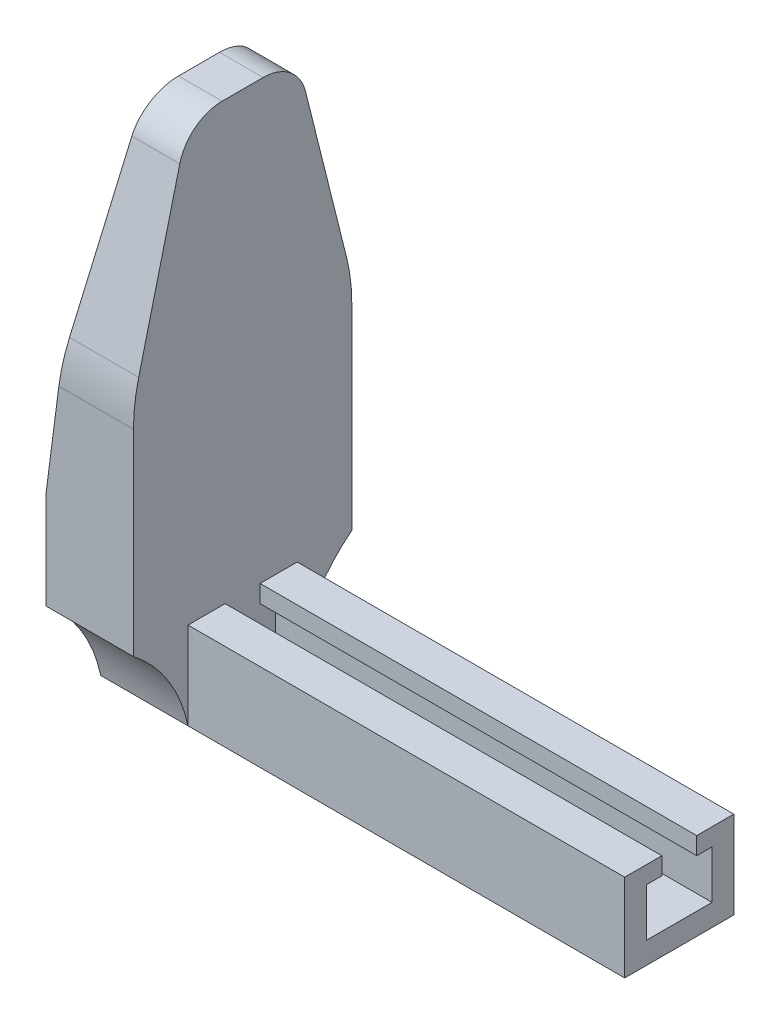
ISO-10303-21;
HEADER;
FILE_DESCRIPTION(('STEP AP214'),'2;1');
FILE_NAME('part.step','',(''),(''),'','','');
FILE_SCHEMA(('AUTOMOTIVE_DESIGN { 1 0 10303 214 1 1 1 1 }'));
ENDSEC;
DATA;
#1=APPLICATION_CONTEXT('core data for automotive mechanical design processes');
#2=APPLICATION_PROTOCOL_DEFINITION('international standard','automotive_design',2000,#1);
#3=PRODUCT_CONTEXT('',#1,'mechanical');
#4=PRODUCT('Part','Part','',(#3));
#5=PRODUCT_RELATED_PRODUCT_CATEGORY('part','',(#4));
#6=PRODUCT_DEFINITION_FORMATION('','',#4);
#7=PRODUCT_DEFINITION_CONTEXT('part definition',#1,'design');
#8=PRODUCT_DEFINITION('design','',#6,#7);
#9=PRODUCT_DEFINITION_SHAPE('','',#8);
#10=(LENGTH_UNIT() NAMED_UNIT(*) SI_UNIT(.MILLI.,.METRE.));
#11=(NAMED_UNIT(*) PLANE_ANGLE_UNIT() SI_UNIT($,.RADIAN.));
#12=(NAMED_UNIT(*) SI_UNIT($,.STERADIAN.) SOLID_ANGLE_UNIT());
#13=UNCERTAINTY_MEASURE_WITH_UNIT(LENGTH_MEASURE(1.E-05),#10,'distance_accuracy_value','');
#14=(GEOMETRIC_REPRESENTATION_CONTEXT(3) GLOBAL_UNCERTAINTY_ASSIGNED_CONTEXT((#13)) GLOBAL_UNIT_ASSIGNED_CONTEXT((#10,
#11,#12)) REPRESENTATION_CONTEXT('',''));
#15=CARTESIAN_POINT('',(0.,0.,0.));
#16=DIRECTION('',(0.,0.,1.));
#17=DIRECTION('',(1.,0.,0.));
#18=AXIS2_PLACEMENT_3D('',#15,#16,#17);
#19=CARTESIAN_POINT('',(100.,-10.,-12.5));
#20=DIRECTION('',(0.,0.,1.));
#21=DIRECTION('',(1.,0.,0.));
#22=AXIS2_PLACEMENT_3D('',#19,#20,#21);
#23=PLANE('',#22);
#24=DIRECTION('',(0.,1.,0.));
#25=VECTOR('',#24,1.);
#26=CARTESIAN_POINT('',(0.,-10.,-12.5));
#27=LINE('',#26,#25);
#28=CARTESIAN_POINT('',(0.,-10.,-12.5));
#29=VERTEX_POINT('',#28);
#30=CARTESIAN_POINT('',(0.,10.,-12.5));
#31=VERTEX_POINT('',#30);
#32=EDGE_CURVE('E142',#29,#31,#27,.T.);
#33=ORIENTED_EDGE('',*,*,#32,.T.);
#34=DIRECTION('',(-1.,0.,0.));
#35=VECTOR('',#34,1.);
#36=CARTESIAN_POINT('',(100.,10.,-12.5));
#37=LINE('',#36,#35);
#38=CARTESIAN_POINT('',(100.,10.,-12.5));
#39=VERTEX_POINT('',#38);
#40=EDGE_CURVE('E11',#39,#31,#37,.T.);
#41=ORIENTED_EDGE('',*,*,#40,.F.);
#42=DIRECTION('',(0.,1.,0.));
#43=VECTOR('',#42,1.);
#44=CARTESIAN_POINT('',(100.,-10.,-12.5));
#45=LINE('',#44,#43);
#46=CARTESIAN_POINT('',(100.,-10.,-12.5));
#47=VERTEX_POINT('',#46);
#48=EDGE_CURVE('E169',#47,#39,#45,.T.);
#49=ORIENTED_EDGE('',*,*,#48,.F.);
#50=DIRECTION('',(-1.,0.,0.));
#51=VECTOR('',#50,1.);
#52=CARTESIAN_POINT('',(100.,-10.,-12.5));
#53=LINE('',#52,#51);
#54=EDGE_CURVE('E138',#47,#29,#53,.T.);
#55=ORIENTED_EDGE('',*,*,#54,.T.);
#56=EDGE_LOOP('',(#33,#41,#49,#55));
#57=FACE_BOUND('',#56,.T.);
#58=ADVANCED_FACE('F38',(#57),#23,.F.);
#59=CARTESIAN_POINT('',(100.,10.,-4.));
#60=DIRECTION('',(0.,-1.,0.));
#61=DIRECTION('',(0.,0.,-1.));
#62=AXIS2_PLACEMENT_3D('',#59,#60,#61);
#63=PLANE('',#62);
#64=DIRECTION('',(0.,0.,1.));
#65=VECTOR('',#64,1.);
#66=CARTESIAN_POINT('',(0.,10.,-4.));
#67=LINE('',#66,#65);
#68=CARTESIAN_POINT('',(0.,10.,-4.));
#69=VERTEX_POINT('',#68);
#70=EDGE_CURVE('E145',#31,#69,#67,.T.);
#71=ORIENTED_EDGE('',*,*,#70,.T.);
#72=DIRECTION('',(-1.,0.,0.));
#73=VECTOR('',#72,1.);
#74=CARTESIAN_POINT('',(100.,10.,-4.));
#75=LINE('',#74,#73);
#76=CARTESIAN_POINT('',(100.,10.,-4.));
#77=VERTEX_POINT('',#76);
#78=EDGE_CURVE('E45',#77,#69,#75,.T.);
#79=ORIENTED_EDGE('',*,*,#78,.F.);
#80=DIRECTION('',(0.,0.,1.));
#81=VECTOR('',#80,1.);
#82=CARTESIAN_POINT('',(100.,10.,-4.));
#83=LINE('',#82,#81);
#84=EDGE_CURVE('E201',#39,#77,#83,.T.);
#85=ORIENTED_EDGE('',*,*,#84,.F.);
#86=ORIENTED_EDGE('',*,*,#40,.T.);
#87=EDGE_LOOP('',(#71,#79,#85,#86));
#88=FACE_BOUND('',#87,.T.);
#89=ADVANCED_FACE('F200',(#88),#63,.F.);
#90=CARTESIAN_POINT('',(100.,10.,-4.));
#91=DIRECTION('',(0.,0.,-1.));
#92=DIRECTION('',(0.,1.,0.));
#93=AXIS2_PLACEMENT_3D('',#90,#91,#92);
#94=PLANE('',#93);
#95=DIRECTION('',(0.,-1.,0.));
#96=VECTOR('',#95,1.);
#97=CARTESIAN_POINT('',(0.,10.,-4.));
#98=LINE('',#97,#96);
#99=CARTESIAN_POINT('',(0.,6.,-4.));
#100=VERTEX_POINT('',#99);
#101=EDGE_CURVE('E74',#69,#100,#98,.T.);
#102=ORIENTED_EDGE('',*,*,#101,.T.);
#103=DIRECTION('',(-1.,0.,0.));
#104=VECTOR('',#103,1.);
#105=CARTESIAN_POINT('',(100.,6.,-4.));
#106=LINE('',#105,#104);
#107=CARTESIAN_POINT('',(100.,6.,-4.));
#108=VERTEX_POINT('',#107);
#109=EDGE_CURVE('E189',#108,#100,#106,.T.);
#110=ORIENTED_EDGE('',*,*,#109,.F.);
#111=DIRECTION('',(0.,-1.,0.));
#112=VECTOR('',#111,1.);
#113=CARTESIAN_POINT('',(100.,10.,-4.));
#114=LINE('',#113,#112);
#115=EDGE_CURVE('E198',#77,#108,#114,.T.);
#116=ORIENTED_EDGE('',*,*,#115,.F.);
#117=ORIENTED_EDGE('',*,*,#78,.T.);
#118=EDGE_LOOP('',(#102,#110,#116,#117));
#119=FACE_BOUND('',#118,.T.);
#120=ADVANCED_FACE('F195',(#119),#94,.F.);
#121=CARTESIAN_POINT('',(100.,6.,-4.));
#122=DIRECTION('',(0.,1.,0.));
#123=DIRECTION('',(0.,0.,1.));
#124=AXIS2_PLACEMENT_3D('',#121,#122,#123);
#125=PLANE('',#124);
#126=DIRECTION('',(0.,0.,-1.));
#127=VECTOR('',#126,1.);
#128=CARTESIAN_POINT('',(0.,6.,-4.));
#129=LINE('',#128,#127);
#130=CARTESIAN_POINT('',(0.,6.,-7.5));
#131=VERTEX_POINT('',#130);
#132=EDGE_CURVE('E149',#100,#131,#129,.T.);
#133=ORIENTED_EDGE('',*,*,#132,.T.);
#134=DIRECTION('',(-1.,0.,0.));
#135=VECTOR('',#134,1.);
#136=CARTESIAN_POINT('',(100.,6.,-7.5));
#137=LINE('',#136,#135);
#138=CARTESIAN_POINT('',(100.,6.,-7.5));
#139=VERTEX_POINT('',#138);
#140=EDGE_CURVE('E186',#139,#131,#137,.T.);
#141=ORIENTED_EDGE('',*,*,#140,.F.);
#142=DIRECTION('',(0.,0.,-1.));
#143=VECTOR('',#142,1.);
#144=CARTESIAN_POINT('',(100.,6.,-4.));
#145=LINE('',#144,#143);
#146=EDGE_CURVE('E247',#108,#139,#145,.T.);
#147=ORIENTED_EDGE('',*,*,#146,.F.);
#148=ORIENTED_EDGE('',*,*,#109,.T.);
#149=EDGE_LOOP('',(#133,#141,#147,#148));
#150=FACE_BOUND('',#149,.T.);
#151=ADVANCED_FACE('F429',(#150),#125,.F.);
#152=CARTESIAN_POINT('',(100.,6.,-7.5));
#153=DIRECTION('',(0.,0.,-1.));
#154=DIRECTION('',(0.,1.,0.));
#155=AXIS2_PLACEMENT_3D('',#152,#153,#154);
#156=PLANE('',#155);
#157=DIRECTION('',(0.,-1.,0.));
#158=VECTOR('',#157,1.);
#159=CARTESIAN_POINT('',(0.,6.,-7.5));
#160=LINE('',#159,#158);
#161=CARTESIAN_POINT('',(0.,-4.99999999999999,-7.5));
#162=VERTEX_POINT('',#161);
#163=EDGE_CURVE('E152',#131,#162,#160,.T.);
#164=ORIENTED_EDGE('',*,*,#163,.T.);
#165=DIRECTION('',(-1.,0.,0.));
#166=VECTOR('',#165,1.);
#167=CARTESIAN_POINT('',(100.,-4.99999999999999,-7.5));
#168=LINE('',#167,#166);
#169=CARTESIAN_POINT('',(100.,-4.99999999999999,-7.5));
#170=VERTEX_POINT('',#169);
#171=EDGE_CURVE('E183',#170,#162,#168,.T.);
#172=ORIENTED_EDGE('',*,*,#171,.F.);
#173=DIRECTION('',(0.,-1.,0.));
#174=VECTOR('',#173,1.);
#175=CARTESIAN_POINT('',(100.,6.,-7.5));
#176=LINE('',#175,#174);
#177=EDGE_CURVE('E245',#139,#170,#176,.T.);
#178=ORIENTED_EDGE('',*,*,#177,.F.);
#179=ORIENTED_EDGE('',*,*,#140,.T.);
#180=EDGE_LOOP('',(#164,#172,#178,#179));
#181=FACE_BOUND('',#180,.T.);
#182=ADVANCED_FACE('F433',(#181),#156,.F.);
#183=CARTESIAN_POINT('',(100.,-4.99999999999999,7.5));
#184=DIRECTION('',(0.,-1.,0.));
#185=DIRECTION('',(0.,0.,-1.));
#186=AXIS2_PLACEMENT_3D('',#183,#184,#185);
#187=PLANE('',#186);
#188=DIRECTION('',(0.,0.,1.));
#189=VECTOR('',#188,1.);
#190=CARTESIAN_POINT('',(0.,-4.99999999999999,7.5));
#191=LINE('',#190,#189);
#192=CARTESIAN_POINT('',(0.,-4.99999999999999,7.5));
#193=VERTEX_POINT('',#192);
#194=EDGE_CURVE('E155',#162,#193,#191,.T.);
#195=ORIENTED_EDGE('',*,*,#194,.T.);
#196=DIRECTION('',(-1.,0.,0.));
#197=VECTOR('',#196,1.);
#198=CARTESIAN_POINT('',(100.,-4.99999999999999,7.5));
#199=LINE('',#198,#197);
#200=CARTESIAN_POINT('',(100.,-4.99999999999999,7.5));
#201=VERTEX_POINT('',#200);
#202=EDGE_CURVE('E180',#201,#193,#199,.T.);
#203=ORIENTED_EDGE('',*,*,#202,.F.);
#204=DIRECTION('',(0.,0.,1.));
#205=VECTOR('',#204,1.);
#206=CARTESIAN_POINT('',(100.,-4.99999999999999,7.5));
#207=LINE('',#206,#205);
#208=EDGE_CURVE('E243',#170,#201,#207,.T.);
#209=ORIENTED_EDGE('',*,*,#208,.F.);
#210=ORIENTED_EDGE('',*,*,#171,.T.);
#211=EDGE_LOOP('',(#195,#203,#209,#210));
#212=FACE_BOUND('',#211,.T.);
#213=ADVANCED_FACE('F438',(#212),#187,.F.);
#214=CARTESIAN_POINT('',(100.,6.,7.5));
#215=DIRECTION('',(0.,0.,1.));
#216=DIRECTION('',(1.,0.,0.));
#217=AXIS2_PLACEMENT_3D('',#214,#215,#216);
#218=PLANE('',#217);
#219=DIRECTION('',(0.,1.,0.));
#220=VECTOR('',#219,1.);
#221=CARTESIAN_POINT('',(0.,6.,7.5));
#222=LINE('',#221,#220);
#223=CARTESIAN_POINT('',(0.,6.,7.5));
#224=VERTEX_POINT('',#223);
#225=EDGE_CURVE('E158',#193,#224,#222,.T.);
#226=ORIENTED_EDGE('',*,*,#225,.T.);
#227=DIRECTION('',(-1.,0.,0.));
#228=VECTOR('',#227,1.);
#229=CARTESIAN_POINT('',(100.,6.,7.5));
#230=LINE('',#229,#228);
#231=CARTESIAN_POINT('',(100.,6.,7.5));
#232=VERTEX_POINT('',#231);
#233=EDGE_CURVE('E177',#232,#224,#230,.T.);
#234=ORIENTED_EDGE('',*,*,#233,.F.);
#235=DIRECTION('',(0.,1.,0.));
#236=VECTOR('',#235,1.);
#237=CARTESIAN_POINT('',(100.,6.,7.5));
#238=LINE('',#237,#236);
#239=EDGE_CURVE('E239',#201,#232,#238,.T.);
#240=ORIENTED_EDGE('',*,*,#239,.F.);
#241=ORIENTED_EDGE('',*,*,#202,.T.);
#242=EDGE_LOOP('',(#226,#234,#240,#241));
#243=FACE_BOUND('',#242,.T.);
#244=ADVANCED_FACE('F440',(#243),#218,.F.);
#245=CARTESIAN_POINT('',(100.,6.,7.5));
#246=DIRECTION('',(0.,1.,0.));
#247=DIRECTION('',(0.,0.,1.));
#248=AXIS2_PLACEMENT_3D('',#245,#246,#247);
#249=PLANE('',#248);
#250=DIRECTION('',(0.,0.,-1.));
#251=VECTOR('',#250,1.);
#252=CARTESIAN_POINT('',(0.,6.,7.5));
#253=LINE('',#252,#251);
#254=CARTESIAN_POINT('',(0.,6.,4.));
#255=VERTEX_POINT('',#254);
#256=EDGE_CURVE('E161',#224,#255,#253,.T.);
#257=ORIENTED_EDGE('',*,*,#256,.T.);
#258=DIRECTION('',(-1.,0.,0.));
#259=VECTOR('',#258,1.);
#260=CARTESIAN_POINT('',(100.,6.,4.));
#261=LINE('',#260,#259);
#262=CARTESIAN_POINT('',(100.,6.,4.));
#263=VERTEX_POINT('',#262);
#264=EDGE_CURVE('E174',#263,#255,#261,.T.);
#265=ORIENTED_EDGE('',*,*,#264,.F.);
#266=DIRECTION('',(0.,0.,-1.));
#267=VECTOR('',#266,1.);
#268=CARTESIAN_POINT('',(100.,6.,7.5));
#269=LINE('',#268,#267);
#270=EDGE_CURVE('E238',#232,#263,#269,.T.);
#271=ORIENTED_EDGE('',*,*,#270,.F.);
#272=ORIENTED_EDGE('',*,*,#233,.T.);
#273=EDGE_LOOP('',(#257,#265,#271,#272));
#274=FACE_BOUND('',#273,.T.);
#275=ADVANCED_FACE('F234',(#274),#249,.F.);
#276=CARTESIAN_POINT('',(100.,10.,4.));
#277=DIRECTION('',(0.,0.,1.));
#278=DIRECTION('',(0.,-1.,0.));
#279=AXIS2_PLACEMENT_3D('',#276,#277,#278);
#280=PLANE('',#279);
#281=DIRECTION('',(0.,1.,0.));
#282=VECTOR('',#281,1.);
#283=CARTESIAN_POINT('',(0.,10.,4.));
#284=LINE('',#283,#282);
#285=CARTESIAN_POINT('',(0.,10.,4.));
#286=VERTEX_POINT('',#285);
#287=EDGE_CURVE('E164',#255,#286,#284,.T.);
#288=ORIENTED_EDGE('',*,*,#287,.T.);
#289=DIRECTION('',(-1.,0.,0.));
#290=VECTOR('',#289,1.);
#291=CARTESIAN_POINT('',(100.,10.,4.));
#292=LINE('',#291,#290);
#293=CARTESIAN_POINT('',(100.,10.,4.));
#294=VERTEX_POINT('',#293);
#295=EDGE_CURVE('E132',#294,#286,#292,.T.);
#296=ORIENTED_EDGE('',*,*,#295,.F.);
#297=DIRECTION('',(0.,1.,0.));
#298=VECTOR('',#297,1.);
#299=CARTESIAN_POINT('',(100.,10.,4.));
#300=LINE('',#299,#298);
#301=EDGE_CURVE('E122',#263,#294,#300,.T.);
#302=ORIENTED_EDGE('',*,*,#301,.F.);
#303=ORIENTED_EDGE('',*,*,#264,.T.);
#304=EDGE_LOOP('',(#288,#296,#302,#303));
#305=FACE_BOUND('',#304,.T.);
#306=ADVANCED_FACE('F237',(#305),#280,.F.);
#307=CARTESIAN_POINT('',(100.,10.,12.5));
#308=DIRECTION('',(0.,-1.,0.));
#309=DIRECTION('',(0.,0.,-1.));
#310=AXIS2_PLACEMENT_3D('',#307,#308,#309);
#311=PLANE('',#310);
#312=DIRECTION('',(0.,0.,1.));
#313=VECTOR('',#312,1.);
#314=CARTESIAN_POINT('',(0.,10.,12.5));
#315=LINE('',#314,#313);
#316=CARTESIAN_POINT('',(0.,10.,12.5));
#317=VERTEX_POINT('',#316);
#318=EDGE_CURVE('E130',#286,#317,#315,.T.);
#319=ORIENTED_EDGE('',*,*,#318,.T.);
#320=DIRECTION('',(-1.,0.,0.));
#321=VECTOR('',#320,1.);
#322=CARTESIAN_POINT('',(100.,10.,12.5));
#323=LINE('',#322,#321);
#324=CARTESIAN_POINT('',(100.,10.,12.5));
#325=VERTEX_POINT('',#324);
#326=EDGE_CURVE('E128',#325,#317,#323,.T.);
#327=ORIENTED_EDGE('',*,*,#326,.F.);
#328=DIRECTION('',(0.,0.,1.));
#329=VECTOR('',#328,1.);
#330=CARTESIAN_POINT('',(100.,10.,12.5));
#331=LINE('',#330,#329);
#332=EDGE_CURVE('E115',#294,#325,#331,.T.);
#333=ORIENTED_EDGE('',*,*,#332,.F.);
#334=ORIENTED_EDGE('',*,*,#295,.T.);
#335=EDGE_LOOP('',(#319,#327,#333,#334));
#336=FACE_BOUND('',#335,.T.);
#337=ADVANCED_FACE('F129',(#336),#311,.F.);
#338=CARTESIAN_POINT('',(100.,-10.,12.5));
#339=DIRECTION('',(0.,0.,-1.));
#340=DIRECTION('',(-1.,0.,0.));
#341=AXIS2_PLACEMENT_3D('',#338,#339,#340);
#342=PLANE('',#341);
#343=DIRECTION('',(0.,-1.,0.));
#344=VECTOR('',#343,1.);
#345=CARTESIAN_POINT('',(0.,-10.,12.5));
#346=LINE('',#345,#344);
#347=CARTESIAN_POINT('',(0.,-10.,12.5));
#348=VERTEX_POINT('',#347);
#349=EDGE_CURVE('E85',#317,#348,#346,.T.);
#350=ORIENTED_EDGE('',*,*,#349,.T.);
#351=DIRECTION('',(-1.,0.,0.));
#352=VECTOR('',#351,1.);
#353=CARTESIAN_POINT('',(100.,-10.,12.5));
#354=LINE('',#353,#352);
#355=CARTESIAN_POINT('',(100.,-10.,12.5));
#356=VERTEX_POINT('',#355);
#357=EDGE_CURVE('E133',#356,#348,#354,.T.);
#358=ORIENTED_EDGE('',*,*,#357,.F.);
#359=DIRECTION('',(0.,-1.,0.));
#360=VECTOR('',#359,1.);
#361=CARTESIAN_POINT('',(100.,-10.,12.5));
#362=LINE('',#361,#360);
#363=EDGE_CURVE('E119',#325,#356,#362,.T.);
#364=ORIENTED_EDGE('',*,*,#363,.F.);
#365=ORIENTED_EDGE('',*,*,#326,.T.);
#366=EDGE_LOOP('',(#350,#358,#364,#365));
#367=FACE_BOUND('',#366,.T.);
#368=ADVANCED_FACE('F135',(#367),#342,.F.);
#369=CARTESIAN_POINT('',(100.,-10.,12.5));
#370=DIRECTION('',(0.,1.,0.));
#371=DIRECTION('',(0.,0.,1.));
#372=AXIS2_PLACEMENT_3D('',#369,#370,#371);
#373=PLANE('',#372);
#374=ORIENTED_EDGE('',*,*,#357,.T.);
#375=DIRECTION('',(1.,0.,0.));
#376=VECTOR('',#375,1.);
#377=CARTESIAN_POINT('',(-20.,-10.,12.5));
#378=LINE('',#377,#376);
#379=CARTESIAN_POINT('',(-20.,-10.,12.5));
#380=VERTEX_POINT('',#379);
#381=EDGE_CURVE('E253',#380,#348,#378,.T.);
#382=ORIENTED_EDGE('',*,*,#381,.F.);
#383=DIRECTION('',(0.,0.,-1.));
#384=VECTOR('',#383,1.);
#385=CARTESIAN_POINT('',(-20.,-10.,12.5));
#386=LINE('',#385,#384);
#387=CARTESIAN_POINT('',(-20.,-10.,-12.5));
#388=VERTEX_POINT('',#387);
#389=EDGE_CURVE('E329',#380,#388,#386,.T.);
#390=ORIENTED_EDGE('',*,*,#389,.T.);
#391=DIRECTION('',(1.,0.,0.));
#392=VECTOR('',#391,1.);
#393=CARTESIAN_POINT('',(-20.,-10.,-12.5));
#394=LINE('',#393,#392);
#395=EDGE_CURVE('E146',#388,#29,#394,.T.);
#396=ORIENTED_EDGE('',*,*,#395,.T.);
#397=ORIENTED_EDGE('',*,*,#54,.F.);
#398=DIRECTION('',(0.,0.,-1.));
#399=VECTOR('',#398,1.);
#400=CARTESIAN_POINT('',(100.,-10.,12.5));
#401=LINE('',#400,#399);
#402=EDGE_CURVE('E61',#356,#47,#401,.T.);
#403=ORIENTED_EDGE('',*,*,#402,.F.);
#404=EDGE_LOOP('',(#374,#382,#390,#396,#397,#403));
#405=FACE_BOUND('',#404,.T.);
#406=ADVANCED_FACE('F423',(#405),#373,.F.);
#407=CARTESIAN_POINT('',(100.,0.,0.));
#408=DIRECTION('',(-1.,0.,0.));
#409=DIRECTION('',(0.,0.,1.));
#410=AXIS2_PLACEMENT_3D('',#407,#408,#409);
#411=PLANE('',#410);
#412=ORIENTED_EDGE('',*,*,#48,.T.);
#413=ORIENTED_EDGE('',*,*,#84,.T.);
#414=ORIENTED_EDGE('',*,*,#115,.T.);
#415=ORIENTED_EDGE('',*,*,#146,.T.);
#416=ORIENTED_EDGE('',*,*,#177,.T.);
#417=ORIENTED_EDGE('',*,*,#208,.T.);
#418=ORIENTED_EDGE('',*,*,#239,.T.);
#419=ORIENTED_EDGE('',*,*,#270,.T.);
#420=ORIENTED_EDGE('',*,*,#301,.T.);
#421=ORIENTED_EDGE('',*,*,#332,.T.);
#422=ORIENTED_EDGE('',*,*,#363,.T.);
#423=ORIENTED_EDGE('',*,*,#402,.T.);
#424=EDGE_LOOP('',(#412,#413,#414,#415,#416,#417,#418,#419,#420,#421,#422,#423));
#425=FACE_BOUND('',#424,.T.);
#426=ADVANCED_FACE('F117',(#425),#411,.F.);
#427=CARTESIAN_POINT('',(0.,-17.0483299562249,-46.0273279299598));
#428=DIRECTION('',(1.,0.,0.));
#429=DIRECTION('',(0.,0.,-1.));
#430=AXIS2_PLACEMENT_3D('',#427,#428,#429);
#431=PLANE('',#430);
#432=ORIENTED_EDGE('',*,*,#32,.F.);
#433=CARTESIAN_POINT('',(0.,-17.0483299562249,-46.0273279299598));
#434=DIRECTION('',(1.,0.,0.));
#435=DIRECTION('',(0.,0.,-1.));
#436=AXIS2_PLACEMENT_3D('',#433,#434,#435);
#437=CIRCLE('',#436,34.2601907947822);
#438=CARTESIAN_POINT('',(0.,10.,-25.));
#439=VERTEX_POINT('',#438);
#440=EDGE_CURVE('E317',#439,#29,#437,.T.);
#441=ORIENTED_EDGE('',*,*,#440,.F.);
#442=DIRECTION('',(0.,1.,0.));
#443=VECTOR('',#442,1.);
#444=CARTESIAN_POINT('',(0.,10.,-25.));
#445=LINE('',#444,#443);
#446=CARTESIAN_POINT('',(0.,55.0757749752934,-25.));
#447=VERTEX_POINT('',#446);
#448=EDGE_CURVE('E287',#439,#447,#445,.T.);
#449=ORIENTED_EDGE('',*,*,#448,.T.);
#450=CARTESIAN_POINT('',(0.,55.0757749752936,15.));
#451=DIRECTION('',(-1.,0.,0.));
#452=DIRECTION('',(0.,0.,1.));
#453=AXIS2_PLACEMENT_3D('',#450,#451,#452);
#454=CIRCLE('',#453,40.);
#455=CARTESIAN_POINT('',(0.,64.777199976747,-23.8057000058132));
#456=VERTEX_POINT('',#455);
#457=EDGE_CURVE('E291',#456,#447,#454,.T.);
#458=ORIENTED_EDGE('',*,*,#457,.F.);
#459=DIRECTION('',(0.,0.970142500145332,0.242535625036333));
#460=VECTOR('',#459,1.);
#461=CARTESIAN_POINT('',(0.,64.777199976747,-23.8057000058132));
#462=LINE('',#461,#460);
#463=CARTESIAN_POINT('',(0.,102.425356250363,-14.3936609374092));
#464=VERTEX_POINT('',#463);
#465=EDGE_CURVE('E294',#456,#464,#462,.T.);
#466=ORIENTED_EDGE('',*,*,#465,.T.);
#467=CARTESIAN_POINT('',(0.,100.,-4.69223593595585));
#468=DIRECTION('',(1.,0.,0.));
#469=DIRECTION('',(0.,0.,-1.));
#470=AXIS2_PLACEMENT_3D('',#467,#468,#469);
#471=CIRCLE('',#470,10.);
#472=CARTESIAN_POINT('',(0.,110.,-4.6922359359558));
#473=VERTEX_POINT('',#472);
#474=EDGE_CURVE('E297',#464,#473,#471,.T.);
#475=ORIENTED_EDGE('',*,*,#474,.T.);
#476=DIRECTION('',(0.,0.,-1.));
#477=VECTOR('',#476,1.);
#478=CARTESIAN_POINT('',(0.,110.,4.69223593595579));
#479=LINE('',#478,#477);
#480=CARTESIAN_POINT('',(0.,110.,4.69223593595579));
#481=VERTEX_POINT('',#480);
#482=EDGE_CURVE('E300',#481,#473,#479,.T.);
#483=ORIENTED_EDGE('',*,*,#482,.F.);
#484=CARTESIAN_POINT('',(0.,100.,4.69223593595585));
#485=DIRECTION('',(-1.,0.,0.));
#486=DIRECTION('',(0.,0.,1.));
#487=AXIS2_PLACEMENT_3D('',#484,#485,#486);
#488=CIRCLE('',#487,10.);
#489=CARTESIAN_POINT('',(0.,102.425356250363,14.3936609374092));
#490=VERTEX_POINT('',#489);
#491=EDGE_CURVE('E303',#490,#481,#488,.T.);
#492=ORIENTED_EDGE('',*,*,#491,.F.);
#493=DIRECTION('',(0.,0.970142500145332,-0.242535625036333));
#494=VECTOR('',#493,1.);
#495=CARTESIAN_POINT('',(0.,64.7771999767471,23.8057000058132));
#496=LINE('',#495,#494);
#497=CARTESIAN_POINT('',(0.,64.7771999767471,23.8057000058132));
#498=VERTEX_POINT('',#497);
#499=EDGE_CURVE('E306',#498,#490,#496,.T.);
#500=ORIENTED_EDGE('',*,*,#499,.F.);
#501=CARTESIAN_POINT('',(0.,55.0757749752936,-15.));
#502=DIRECTION('',(1.,0.,0.));
#503=DIRECTION('',(0.,0.,-1.));
#504=AXIS2_PLACEMENT_3D('',#501,#502,#503);
#505=CIRCLE('',#504,40.);
#506=CARTESIAN_POINT('',(0.,55.0757749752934,25.));
#507=VERTEX_POINT('',#506);
#508=EDGE_CURVE('E309',#498,#507,#505,.T.);
#509=ORIENTED_EDGE('',*,*,#508,.T.);
#510=DIRECTION('',(0.,1.,0.));
#511=VECTOR('',#510,1.);
#512=CARTESIAN_POINT('',(0.,10.,25.));
#513=LINE('',#512,#511);
#514=CARTESIAN_POINT('',(0.,10.,25.));
#515=VERTEX_POINT('',#514);
#516=EDGE_CURVE('E312',#515,#507,#513,.T.);
#517=ORIENTED_EDGE('',*,*,#516,.F.);
#518=CARTESIAN_POINT('',(0.,-17.0483299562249,46.0273279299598));
#519=DIRECTION('',(-1.,0.,0.));
#520=DIRECTION('',(0.,0.,1.));
#521=AXIS2_PLACEMENT_3D('',#518,#519,#520);
#522=CIRCLE('',#521,34.2601907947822);
#523=EDGE_CURVE('E315',#515,#348,#522,.T.);
#524=ORIENTED_EDGE('',*,*,#523,.T.);
#525=ORIENTED_EDGE('',*,*,#349,.F.);
#526=ORIENTED_EDGE('',*,*,#318,.F.);
#527=ORIENTED_EDGE('',*,*,#287,.F.);
#528=ORIENTED_EDGE('',*,*,#256,.F.);
#529=ORIENTED_EDGE('',*,*,#225,.F.);
#530=ORIENTED_EDGE('',*,*,#194,.F.);
#531=ORIENTED_EDGE('',*,*,#163,.F.);
#532=ORIENTED_EDGE('',*,*,#132,.F.);
#533=ORIENTED_EDGE('',*,*,#101,.F.);
#534=ORIENTED_EDGE('',*,*,#70,.F.);
#535=EDGE_LOOP('',(#432,#441,#449,#458,#466,#475,#483,#492,#500,#509,#517,#524,#525,#526,#527,
#528,#529,#530,#531,#532,#533,#534));
#536=FACE_BOUND('',#535,.T.);
#537=ADVANCED_FACE('F205',(#536),#431,.T.);
#538=CARTESIAN_POINT('',(-20.,-17.0483299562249,-46.0273279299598));
#539=DIRECTION('',(1.,0.,0.));
#540=DIRECTION('',(0.,0.,-1.));
#541=AXIS2_PLACEMENT_3D('',#538,#539,#540);
#542=CYLINDRICAL_SURFACE('',#541,34.2601907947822);
#543=ORIENTED_EDGE('',*,*,#440,.T.);
#544=ORIENTED_EDGE('',*,*,#395,.F.);
#545=CARTESIAN_POINT('',(-20.,-17.0483299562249,-46.0273279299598));
#546=DIRECTION('',(1.,0.,0.));
#547=DIRECTION('',(0.,0.,-1.));
#548=AXIS2_PLACEMENT_3D('',#545,#546,#547);
#549=CIRCLE('',#548,34.2601907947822);
#550=CARTESIAN_POINT('',(-20.,10.,-25.));
#551=VERTEX_POINT('',#550);
#552=EDGE_CURVE('E290',#551,#388,#549,.T.);
#553=ORIENTED_EDGE('',*,*,#552,.F.);
#554=DIRECTION('',(1.,0.,0.));
#555=VECTOR('',#554,1.);
#556=CARTESIAN_POINT('',(-20.,10.,-25.));
#557=LINE('',#556,#555);
#558=EDGE_CURVE('E283',#551,#439,#557,.T.);
#559=ORIENTED_EDGE('',*,*,#558,.T.);
#560=EDGE_LOOP('',(#543,#544,#553,#559));
#561=FACE_BOUND('',#560,.T.);
#562=ADVANCED_FACE('F531',(#561),#542,.F.);
#563=CARTESIAN_POINT('',(-20.,-17.0483299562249,46.0273279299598));
#564=DIRECTION('',(1.,0.,0.));
#565=DIRECTION('',(0.,0.,-1.));
#566=AXIS2_PLACEMENT_3D('',#563,#564,#565);
#567=CYLINDRICAL_SURFACE('',#566,34.2601907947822);
#568=ORIENTED_EDGE('',*,*,#523,.F.);
#569=DIRECTION('',(1.,0.,0.));
#570=VECTOR('',#569,1.);
#571=CARTESIAN_POINT('',(-20.,10.,25.));
#572=LINE('',#571,#570);
#573=CARTESIAN_POINT('',(-20.,10.,25.));
#574=VERTEX_POINT('',#573);
#575=EDGE_CURVE('E256',#574,#515,#572,.T.);
#576=ORIENTED_EDGE('',*,*,#575,.F.);
#577=CARTESIAN_POINT('',(-20.,-17.0483299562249,46.0273279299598));
#578=DIRECTION('',(-1.,0.,0.));
#579=DIRECTION('',(0.,0.,1.));
#580=AXIS2_PLACEMENT_3D('',#577,#578,#579);
#581=CIRCLE('',#580,34.2601907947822);
#582=EDGE_CURVE('E326',#574,#380,#581,.T.);
#583=ORIENTED_EDGE('',*,*,#582,.T.);
#584=ORIENTED_EDGE('',*,*,#381,.T.);
#585=EDGE_LOOP('',(#568,#576,#583,#584));
#586=FACE_BOUND('',#585,.T.);
#587=ADVANCED_FACE('F420',(#586),#567,.F.);
#588=CARTESIAN_POINT('',(-20.,10.,25.));
#589=DIRECTION('',(0.,0.,-1.));
#590=DIRECTION('',(-1.,0.,0.));
#591=AXIS2_PLACEMENT_3D('',#588,#589,#590);
#592=PLANE('',#591);
#593=DIRECTION('',(1.,0.,0.));
#594=VECTOR('',#593,1.);
#595=CARTESIAN_POINT('',(-20.,55.0757749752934,25.));
#596=LINE('',#595,#594);
#597=CARTESIAN_POINT('',(-17.0904630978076,55.0757749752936,25.));
#598=VERTEX_POINT('',#597);
#599=EDGE_CURVE('E259',#598,#507,#596,.T.);
#600=ORIENTED_EDGE('',*,*,#599,.F.);
#601=DIRECTION('',(0.128032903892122,0.991769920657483,0.));
#602=VECTOR('',#601,1.);
#603=CARTESIAN_POINT('',(-10.,110.,25.));
#604=LINE('',#603,#602);
#605=CARTESIAN_POINT('',(-20.,32.5378874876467,25.));
#606=VERTEX_POINT('',#605);
#607=EDGE_CURVE('E357',#606,#598,#604,.T.);
#608=ORIENTED_EDGE('',*,*,#607,.F.);
#609=DIRECTION('',(0.,1.,0.));
#610=VECTOR('',#609,1.);
#611=CARTESIAN_POINT('',(-20.,10.,25.));
#612=LINE('',#611,#610);
#613=EDGE_CURVE('E323',#574,#606,#612,.T.);
#614=ORIENTED_EDGE('',*,*,#613,.F.);
#615=ORIENTED_EDGE('',*,*,#575,.T.);
#616=ORIENTED_EDGE('',*,*,#516,.T.);
#617=EDGE_LOOP('',(#600,#608,#614,#615,#616));
#618=FACE_BOUND('',#617,.T.);
#619=ADVANCED_FACE('F376',(#618),#592,.F.);
#620=CARTESIAN_POINT('',(-20.,55.0757749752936,-15.));
#621=DIRECTION('',(1.,0.,0.));
#622=DIRECTION('',(0.,0.,-1.));
#623=AXIS2_PLACEMENT_3D('',#620,#621,#622);
#624=CYLINDRICAL_SURFACE('',#623,40.);
#625=CARTESIAN_POINT('',(-17.0904630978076,55.0757749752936,-15.));
#626=DIRECTION('',(0.991769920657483,-0.128032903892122,0.));
#627=DIRECTION('',(0.128032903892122,0.991769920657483,0.));
#628=AXIS2_PLACEMENT_3D('',#625,#626,#627);
#629=ELLIPSE('',#628,40.3319350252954,40.);
#630=CARTESIAN_POINT('',(-15.8380540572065,64.7771999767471,23.8057000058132));
#631=VERTEX_POINT('',#630);
#632=EDGE_CURVE('E320',#598,#631,#629,.F.);
#633=ORIENTED_EDGE('',*,*,#632,.F.);
#634=ORIENTED_EDGE('',*,*,#599,.T.);
#635=ORIENTED_EDGE('',*,*,#508,.F.);
#636=DIRECTION('',(1.,0.,0.));
#637=VECTOR('',#636,1.);
#638=CARTESIAN_POINT('',(-20.,64.7771999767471,23.8057000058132));
#639=LINE('',#638,#637);
#640=EDGE_CURVE('E262',#631,#498,#639,.T.);
#641=ORIENTED_EDGE('',*,*,#640,.F.);
#642=EDGE_LOOP('',(#633,#634,#635,#641));
#643=FACE_BOUND('',#642,.T.);
#644=ADVANCED_FACE('F373',(#643),#624,.T.);
#645=CARTESIAN_POINT('',(-20.,64.7771999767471,23.8057000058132));
#646=DIRECTION('',(0.,-0.242535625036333,-0.970142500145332));
#647=DIRECTION('',(0.,0.970142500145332,-0.242535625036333));
#648=AXIS2_PLACEMENT_3D('',#645,#646,#647);
#649=PLANE('',#648);
#650=DIRECTION('',(1.,0.,0.));
#651=VECTOR('',#650,1.);
#652=CARTESIAN_POINT('',(-20.,102.425356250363,14.3936609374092));
#653=LINE('',#652,#651);
#654=CARTESIAN_POINT('',(-10.977851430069,102.425356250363,14.3936609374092));
#655=VERTEX_POINT('',#654);
#656=EDGE_CURVE('E265',#655,#490,#653,.T.);
#657=ORIENTED_EDGE('',*,*,#656,.F.);
#658=DIRECTION('',(-0.124270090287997,-0.962622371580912,0.240655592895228));
#659=VECTOR('',#658,1.);
#660=CARTESIAN_POINT('',(-15.9023272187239,64.2793264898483,23.9301683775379));
#661=LINE('',#660,#659);
#662=EDGE_CURVE('E336',#655,#631,#661,.T.);
#663=ORIENTED_EDGE('',*,*,#662,.T.);
#664=ORIENTED_EDGE('',*,*,#640,.T.);
#665=ORIENTED_EDGE('',*,*,#499,.T.);
#666=EDGE_LOOP('',(#657,#663,#664,#665));
#667=FACE_BOUND('',#666,.T.);
#668=ADVANCED_FACE('F560',(#667),#649,.F.);
#669=CARTESIAN_POINT('',(-20.,100.,4.69223593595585));
#670=DIRECTION('',(1.,0.,0.));
#671=DIRECTION('',(0.,0.,-1.));
#672=AXIS2_PLACEMENT_3D('',#669,#670,#671);
#673=CYLINDRICAL_SURFACE('',#672,10.);
#674=DIRECTION('',(1.,0.,0.));
#675=VECTOR('',#674,1.);
#676=CARTESIAN_POINT('',(-20.,110.,4.69223593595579));
#677=LINE('',#676,#675);
#678=CARTESIAN_POINT('',(-10.,110.,4.69223593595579));
#679=VERTEX_POINT('',#678);
#680=EDGE_CURVE('E268',#679,#481,#677,.T.);
#681=ORIENTED_EDGE('',*,*,#680,.F.);
#682=CARTESIAN_POINT('',(-11.2909536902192,100.,4.69223593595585));
#683=DIRECTION('',(0.991769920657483,-0.128032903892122,0.));
#684=DIRECTION('',(0.128032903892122,0.991769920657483,0.));
#685=AXIS2_PLACEMENT_3D('',#682,#683,#684);
#686=ELLIPSE('',#685,10.0829837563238,10.);
#687=EDGE_CURVE('E339',#679,#655,#686,.T.);
#688=ORIENTED_EDGE('',*,*,#687,.T.);
#689=ORIENTED_EDGE('',*,*,#656,.T.);
#690=ORIENTED_EDGE('',*,*,#491,.T.);
#691=EDGE_LOOP('',(#681,#688,#689,#690));
#692=FACE_BOUND('',#691,.T.);
#693=ADVANCED_FACE('F568',(#692),#673,.T.);
#694=CARTESIAN_POINT('',(-20.,110.,4.69223593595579));
#695=DIRECTION('',(0.,-1.,0.));
#696=DIRECTION('',(0.,0.,-1.));
#697=AXIS2_PLACEMENT_3D('',#694,#695,#696);
#698=PLANE('',#697);
#699=DIRECTION('',(1.,0.,0.));
#700=VECTOR('',#699,1.);
#701=CARTESIAN_POINT('',(-20.,110.,-4.6922359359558));
#702=LINE('',#701,#700);
#703=CARTESIAN_POINT('',(-10.,110.,-4.69223593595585));
#704=VERTEX_POINT('',#703);
#705=EDGE_CURVE('E271',#704,#473,#702,.T.);
#706=ORIENTED_EDGE('',*,*,#705,.F.);
#707=DIRECTION('',(0.,0.,1.));
#708=VECTOR('',#707,1.);
#709=CARTESIAN_POINT('',(-10.,110.,-25.));
#710=LINE('',#709,#708);
#711=EDGE_CURVE('E351',#704,#679,#710,.T.);
#712=ORIENTED_EDGE('',*,*,#711,.T.);
#713=ORIENTED_EDGE('',*,*,#680,.T.);
#714=ORIENTED_EDGE('',*,*,#482,.T.);
#715=EDGE_LOOP('',(#706,#712,#713,#714));
#716=FACE_BOUND('',#715,.T.);
#717=ADVANCED_FACE('F576',(#716),#698,.F.);
#718=CARTESIAN_POINT('',(-20.,100.,-4.69223593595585));
#719=DIRECTION('',(1.,0.,0.));
#720=DIRECTION('',(0.,0.,-1.));
#721=AXIS2_PLACEMENT_3D('',#718,#719,#720);
#722=CYLINDRICAL_SURFACE('',#721,10.);
#723=CARTESIAN_POINT('',(-11.2909536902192,100.,-4.69223593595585));
#724=DIRECTION('',(0.991769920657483,-0.128032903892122,0.));
#725=DIRECTION('',(0.128032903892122,0.991769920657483,0.));
#726=AXIS2_PLACEMENT_3D('',#723,#724,#725);
#727=ELLIPSE('',#726,10.0829837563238,10.);
#728=CARTESIAN_POINT('',(-10.977851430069,102.425356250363,-14.3936609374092));
#729=VERTEX_POINT('',#728);
#730=EDGE_CURVE('E342',#704,#729,#727,.F.);
#731=ORIENTED_EDGE('',*,*,#730,.F.);
#732=ORIENTED_EDGE('',*,*,#705,.T.);
#733=ORIENTED_EDGE('',*,*,#474,.F.);
#734=DIRECTION('',(1.,0.,0.));
#735=VECTOR('',#734,1.);
#736=CARTESIAN_POINT('',(-20.,102.425356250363,-14.3936609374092));
#737=LINE('',#736,#735);
#738=EDGE_CURVE('E274',#729,#464,#737,.T.);
#739=ORIENTED_EDGE('',*,*,#738,.F.);
#740=EDGE_LOOP('',(#731,#732,#733,#739));
#741=FACE_BOUND('',#740,.T.);
#742=ADVANCED_FACE('F585',(#741),#722,.T.);
#743=CARTESIAN_POINT('',(-20.,64.777199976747,-23.8057000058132));
#744=DIRECTION('',(0.,0.242535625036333,-0.970142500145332));
#745=DIRECTION('',(0.,0.970142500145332,0.242535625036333));
#746=AXIS2_PLACEMENT_3D('',#743,#744,#745);
#747=PLANE('',#746);
#748=DIRECTION('',(-0.124270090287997,-0.962622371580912,-0.240655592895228));
#749=VECTOR('',#748,1.);
#750=CARTESIAN_POINT('',(-15.9023272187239,64.2793264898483,-23.9301683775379));
#751=LINE('',#750,#749);
#752=CARTESIAN_POINT('',(-15.8380540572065,64.777199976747,-23.8057000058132));
#753=VERTEX_POINT('',#752);
#754=EDGE_CURVE('E345',#729,#753,#751,.T.);
#755=ORIENTED_EDGE('',*,*,#754,.F.);
#756=ORIENTED_EDGE('',*,*,#738,.T.);
#757=ORIENTED_EDGE('',*,*,#465,.F.);
#758=DIRECTION('',(1.,0.,0.));
#759=VECTOR('',#758,1.);
#760=CARTESIAN_POINT('',(-20.,64.777199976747,-23.8057000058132));
#761=LINE('',#760,#759);
#762=EDGE_CURVE('E277',#753,#456,#761,.T.);
#763=ORIENTED_EDGE('',*,*,#762,.F.);
#764=EDGE_LOOP('',(#755,#756,#757,#763));
#765=FACE_BOUND('',#764,.T.);
#766=ADVANCED_FACE('F594',(#765),#747,.T.);
#767=CARTESIAN_POINT('',(-20.,55.0757749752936,15.));
#768=DIRECTION('',(1.,0.,0.));
#769=DIRECTION('',(0.,0.,-1.));
#770=AXIS2_PLACEMENT_3D('',#767,#768,#769);
#771=CYLINDRICAL_SURFACE('',#770,40.);
#772=DIRECTION('',(1.,0.,0.));
#773=VECTOR('',#772,1.);
#774=CARTESIAN_POINT('',(-20.,55.0757749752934,-25.));
#775=LINE('',#774,#773);
#776=CARTESIAN_POINT('',(-17.0904630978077,55.0757749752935,-25.));
#777=VERTEX_POINT('',#776);
#778=EDGE_CURVE('E280',#777,#447,#775,.T.);
#779=ORIENTED_EDGE('',*,*,#778,.F.);
#780=CARTESIAN_POINT('',(-17.0904630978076,55.0757749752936,15.));
#781=DIRECTION('',(0.991769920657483,-0.128032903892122,0.));
#782=DIRECTION('',(0.128032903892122,0.991769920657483,0.));
#783=AXIS2_PLACEMENT_3D('',#780,#781,#782);
#784=ELLIPSE('',#783,40.3319350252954,40.);
#785=EDGE_CURVE('E348',#777,#753,#784,.T.);
#786=ORIENTED_EDGE('',*,*,#785,.T.);
#787=ORIENTED_EDGE('',*,*,#762,.T.);
#788=ORIENTED_EDGE('',*,*,#457,.T.);
#789=EDGE_LOOP('',(#779,#786,#787,#788));
#790=FACE_BOUND('',#789,.T.);
#791=ADVANCED_FACE('F603',(#790),#771,.T.);
#792=CARTESIAN_POINT('',(-20.,10.,-25.));
#793=DIRECTION('',(0.,0.,-1.));
#794=DIRECTION('',(-1.,0.,0.));
#795=AXIS2_PLACEMENT_3D('',#792,#793,#794);
#796=PLANE('',#795);
#797=DIRECTION('',(0.128032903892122,0.991769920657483,0.));
#798=VECTOR('',#797,1.);
#799=CARTESIAN_POINT('',(-10.,110.,-25.));
#800=LINE('',#799,#798);
#801=CARTESIAN_POINT('',(-20.,32.5378874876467,-25.));
#802=VERTEX_POINT('',#801);
#803=EDGE_CURVE('E52',#802,#777,#800,.T.);
#804=ORIENTED_EDGE('',*,*,#803,.T.);
#805=ORIENTED_EDGE('',*,*,#778,.T.);
#806=ORIENTED_EDGE('',*,*,#448,.F.);
#807=ORIENTED_EDGE('',*,*,#558,.F.);
#808=DIRECTION('',(0.,1.,0.));
#809=VECTOR('',#808,1.);
#810=CARTESIAN_POINT('',(-20.,10.,-25.));
#811=LINE('',#810,#809);
#812=EDGE_CURVE('E286',#551,#802,#811,.T.);
#813=ORIENTED_EDGE('',*,*,#812,.T.);
#814=EDGE_LOOP('',(#804,#805,#806,#807,#813));
#815=FACE_BOUND('',#814,.T.);
#816=ADVANCED_FACE('F612',(#815),#796,.T.);
#817=CARTESIAN_POINT('',(-20.,-17.0483299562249,-46.0273279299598));
#818=DIRECTION('',(1.,0.,0.));
#819=DIRECTION('',(0.,0.,-1.));
#820=AXIS2_PLACEMENT_3D('',#817,#818,#819);
#821=PLANE('',#820);
#822=ORIENTED_EDGE('',*,*,#613,.T.);
#823=DIRECTION('',(0.,0.,1.));
#824=VECTOR('',#823,1.);
#825=CARTESIAN_POINT('',(-20.,32.5378874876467,-25.));
#826=LINE('',#825,#824);
#827=EDGE_CURVE('E352',#802,#606,#826,.T.);
#828=ORIENTED_EDGE('',*,*,#827,.F.);
#829=ORIENTED_EDGE('',*,*,#812,.F.);
#830=ORIENTED_EDGE('',*,*,#552,.T.);
#831=ORIENTED_EDGE('',*,*,#389,.F.);
#832=ORIENTED_EDGE('',*,*,#582,.F.);
#833=EDGE_LOOP('',(#822,#828,#829,#830,#831,#832));
#834=FACE_BOUND('',#833,.T.);
#835=ADVANCED_FACE('F621',(#834),#821,.F.);
#836=CARTESIAN_POINT('',(-10.,110.,-25.));
#837=DIRECTION('',(0.991769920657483,-0.128032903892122,0.));
#838=DIRECTION('',(0.128032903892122,0.991769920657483,0.));
#839=AXIS2_PLACEMENT_3D('',#836,#837,#838);
#840=PLANE('',#839);
#841=ORIENTED_EDGE('',*,*,#632,.T.);
#842=ORIENTED_EDGE('',*,*,#662,.F.);
#843=ORIENTED_EDGE('',*,*,#687,.F.);
#844=ORIENTED_EDGE('',*,*,#711,.F.);
#845=ORIENTED_EDGE('',*,*,#730,.T.);
#846=ORIENTED_EDGE('',*,*,#754,.T.);
#847=ORIENTED_EDGE('',*,*,#785,.F.);
#848=ORIENTED_EDGE('',*,*,#803,.F.);
#849=ORIENTED_EDGE('',*,*,#827,.T.);
#850=ORIENTED_EDGE('',*,*,#607,.T.);
#851=EDGE_LOOP('',(#841,#842,#843,#844,#845,#846,#847,#848,#849,#850));
#852=FACE_BOUND('',#851,.T.);
#853=ADVANCED_FACE('F362',(#852),#840,.F.);
#854=CLOSED_SHELL('',(#58,#89,#120,#151,#182,#213,#244,#275,#306,#337,#368,#406,#426,#537,#562,
#587,#619,#644,#668,#693,#717,#742,#766,#791,#816,#835,#853));
#855=MANIFOLD_SOLID_BREP('B2',#854);
#856=ADVANCED_BREP_SHAPE_REPRESENTATION('',(#18,#855),#14);
#857=SHAPE_DEFINITION_REPRESENTATION(#9,#856);
ENDSEC;
END-ISO-10303-21;
